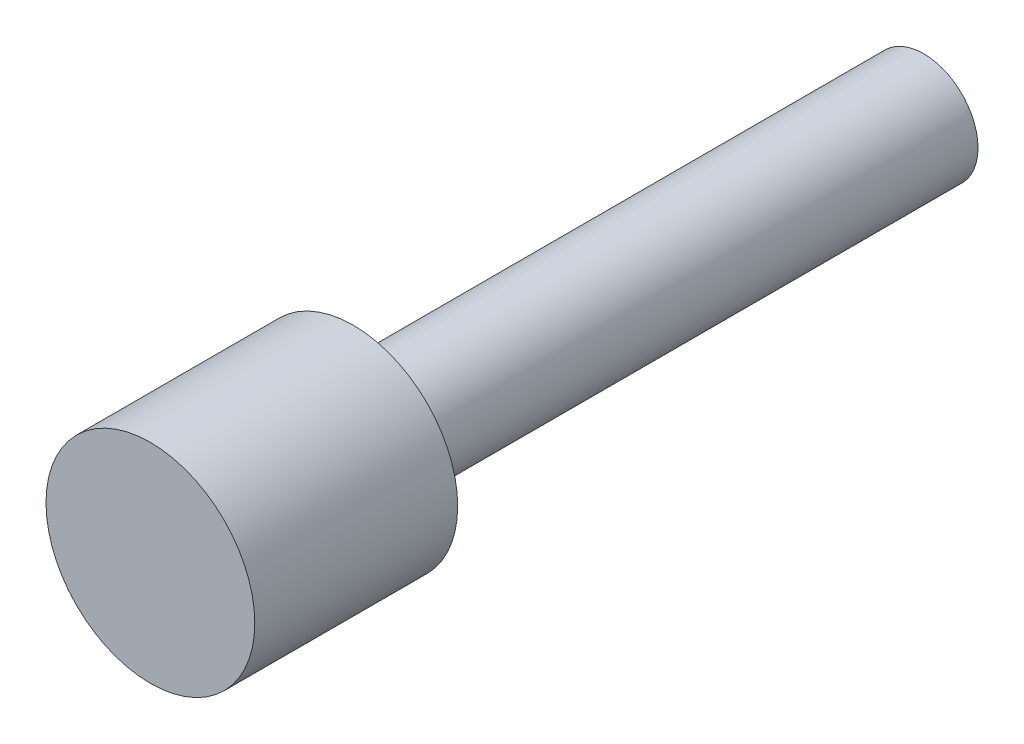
from build123d import *

# Parameters (mm, degrees)
SKETCH1_R           = 4.28625
BOSS_EXTRUDE1_DEPTH = 8.331199
SKETCH2_R           = 2.23266
BOSS_EXTRUDE2_DEPTH = 23.418801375


with BuildPart() as part:
    # Sketch1 → Boss-Extrude1 (new body)
    with BuildSketch(Plane.XY):
        Circle(SKETCH1_R)
    extrude(amount=-BOSS_EXTRUDE1_DEPTH)

    # Sketch2 → Boss-Extrude2 (add)
    with BuildSketch(Plane(origin=(0, 0, -8.331198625), x_dir=(-1, 0, 0), z_dir=(0, 0, -1))):
        with Locations(Location((0, 0, 0), (0, 0, 180))):
            Circle(SKETCH2_R)
    extrude(amount=BOSS_EXTRUDE2_DEPTH)


solid = part.part
